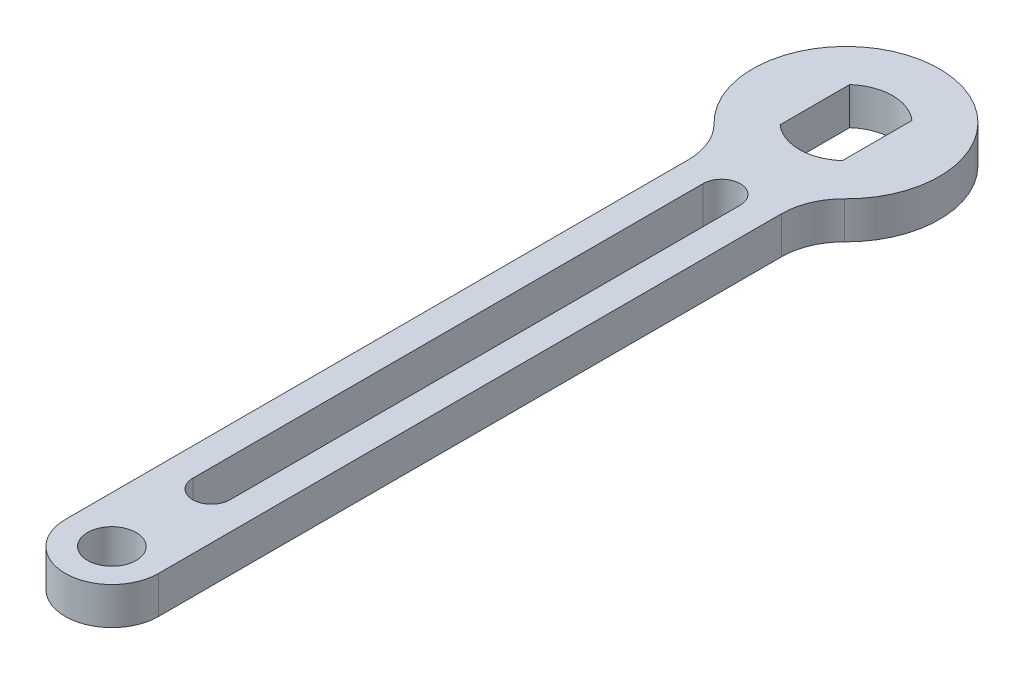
ISO-10303-21;
HEADER;
FILE_DESCRIPTION(('STEP AP214'),'2;1');
FILE_NAME('part.step','',(''),(''),'','','');
FILE_SCHEMA(('AUTOMOTIVE_DESIGN { 1 0 10303 214 1 1 1 1 }'));
ENDSEC;
DATA;
#1=APPLICATION_CONTEXT('core data for automotive mechanical design processes');
#2=APPLICATION_PROTOCOL_DEFINITION('international standard','automotive_design',2000,#1);
#3=PRODUCT_CONTEXT('',#1,'mechanical');
#4=PRODUCT('Part','Part','',(#3));
#5=PRODUCT_RELATED_PRODUCT_CATEGORY('part','',(#4));
#6=PRODUCT_DEFINITION_FORMATION('','',#4);
#7=PRODUCT_DEFINITION_CONTEXT('part definition',#1,'design');
#8=PRODUCT_DEFINITION('design','',#6,#7);
#9=PRODUCT_DEFINITION_SHAPE('','',#8);
#10=(LENGTH_UNIT() NAMED_UNIT(*) SI_UNIT(.MILLI.,.METRE.));
#11=(NAMED_UNIT(*) PLANE_ANGLE_UNIT() SI_UNIT($,.RADIAN.));
#12=(NAMED_UNIT(*) SI_UNIT($,.STERADIAN.) SOLID_ANGLE_UNIT());
#13=UNCERTAINTY_MEASURE_WITH_UNIT(LENGTH_MEASURE(1.E-05),#10,'distance_accuracy_value','');
#14=(GEOMETRIC_REPRESENTATION_CONTEXT(3) GLOBAL_UNCERTAINTY_ASSIGNED_CONTEXT((#13)) GLOBAL_UNIT_ASSIGNED_CONTEXT((#10,
#11,#12)) REPRESENTATION_CONTEXT('',''));
#15=CARTESIAN_POINT('',(0.,0.,0.));
#16=DIRECTION('',(0.,0.,1.));
#17=DIRECTION('',(1.,0.,0.));
#18=AXIS2_PLACEMENT_3D('',#15,#16,#17);
#19=CARTESIAN_POINT('',(-7.50000000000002,-6.,55.25));
#20=DIRECTION('',(-1.,0.,0.));
#21=DIRECTION('',(0.,0.,1.));
#22=AXIS2_PLACEMENT_3D('',#19,#20,#21);
#23=PLANE('',#22);
#24=DIRECTION('',(0.,0.,1.));
#25=VECTOR('',#24,1.);
#26=CARTESIAN_POINT('',(-7.50000000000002,0.,55.25));
#27=LINE('',#26,#25);
#28=CARTESIAN_POINT('',(-7.50000000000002,0.,17.8535710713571));
#29=VERTEX_POINT('',#28);
#30=CARTESIAN_POINT('',(-7.50000000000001,0.,118.));
#31=VERTEX_POINT('',#30);
#32=EDGE_CURVE('E215',#29,#31,#27,.T.);
#33=ORIENTED_EDGE('',*,*,#32,.F.);
#34=DIRECTION('',(0.,-1.,0.));
#35=VECTOR('',#34,1.);
#36=CARTESIAN_POINT('',(-7.50000000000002,-6.,17.8535710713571));
#37=LINE('',#36,#35);
#38=CARTESIAN_POINT('',(-7.50000000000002,-6.,17.8535710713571));
#39=VERTEX_POINT('',#38);
#40=EDGE_CURVE('E244',#29,#39,#37,.T.);
#41=ORIENTED_EDGE('',*,*,#40,.T.);
#42=DIRECTION('',(0.,0.,1.));
#43=VECTOR('',#42,1.);
#44=CARTESIAN_POINT('',(-7.50000000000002,-6.,55.25));
#45=LINE('',#44,#43);
#46=CARTESIAN_POINT('',(-7.50000000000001,-6.,118.));
#47=VERTEX_POINT('',#46);
#48=EDGE_CURVE('E183',#39,#47,#45,.T.);
#49=ORIENTED_EDGE('',*,*,#48,.T.);
#50=DIRECTION('',(0.,1.,0.));
#51=VECTOR('',#50,1.);
#52=CARTESIAN_POINT('',(-7.50000000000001,-6.,118.));
#53=LINE('',#52,#51);
#54=EDGE_CURVE('E225',#47,#31,#53,.T.);
#55=ORIENTED_EDGE('',*,*,#54,.T.);
#56=EDGE_LOOP('',(#33,#41,#49,#55));
#57=FACE_BOUND('',#56,.T.);
#58=ADVANCED_FACE('F34',(#57),#23,.T.);
#59=CARTESIAN_POINT('',(0.,-6.,0.));
#60=DIRECTION('',(0.,1.,0.));
#61=DIRECTION('',(0.,0.,1.));
#62=AXIS2_PLACEMENT_3D('',#59,#60,#61);
#63=CYLINDRICAL_SURFACE('',#62,15.);
#64=CARTESIAN_POINT('',(0.,-6.,0.));
#65=DIRECTION('',(0.,1.,0.));
#66=DIRECTION('',(0.,0.,1.));
#67=AXIS2_PLACEMENT_3D('',#64,#65,#66);
#68=CIRCLE('',#67,15.);
#69=CARTESIAN_POINT('',(10.5,-6.,10.7121426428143));
#70=VERTEX_POINT('',#69);
#71=CARTESIAN_POINT('',(-10.5,-6.,10.7121426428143));
#72=VERTEX_POINT('',#71);
#73=EDGE_CURVE('E156',#70,#72,#68,.T.);
#74=ORIENTED_EDGE('',*,*,#73,.T.);
#75=DIRECTION('',(0.,1.,0.));
#76=VECTOR('',#75,1.);
#77=CARTESIAN_POINT('',(-10.5,-6.,10.7121426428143));
#78=LINE('',#77,#76);
#79=CARTESIAN_POINT('',(-10.5,0.,10.7121426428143));
#80=VERTEX_POINT('',#79);
#81=EDGE_CURVE('E241',#72,#80,#78,.T.);
#82=ORIENTED_EDGE('',*,*,#81,.T.);
#83=CARTESIAN_POINT('',(0.,0.,0.));
#84=DIRECTION('',(0.,1.,0.));
#85=DIRECTION('',(0.,0.,1.));
#86=AXIS2_PLACEMENT_3D('',#83,#84,#85);
#87=CIRCLE('',#86,15.);
#88=CARTESIAN_POINT('',(10.5,0.,10.7121426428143));
#89=VERTEX_POINT('',#88);
#90=EDGE_CURVE('E161',#89,#80,#87,.T.);
#91=ORIENTED_EDGE('',*,*,#90,.F.);
#92=DIRECTION('',(0.,1.,0.));
#93=VECTOR('',#92,1.);
#94=CARTESIAN_POINT('',(10.5,-6.,10.7121426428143));
#95=LINE('',#94,#93);
#96=EDGE_CURVE('E224',#89,#70,#95,.F.);
#97=ORIENTED_EDGE('',*,*,#96,.T.);
#98=EDGE_LOOP('',(#74,#82,#91,#97));
#99=FACE_BOUND('',#98,.T.);
#100=ADVANCED_FACE('F256',(#99),#63,.T.);
#101=CARTESIAN_POINT('',(7.50000000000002,-6.,55.25));
#102=DIRECTION('',(-1.,0.,0.));
#103=DIRECTION('',(0.,0.,1.));
#104=AXIS2_PLACEMENT_3D('',#101,#102,#103);
#105=PLANE('',#104);
#106=DIRECTION('',(0.,0.,1.));
#107=VECTOR('',#106,1.);
#108=CARTESIAN_POINT('',(7.50000000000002,-6.,55.25));
#109=LINE('',#108,#107);
#110=CARTESIAN_POINT('',(7.50000000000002,-6.,17.8535710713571));
#111=VERTEX_POINT('',#110);
#112=CARTESIAN_POINT('',(7.50000000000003,-6.,118.));
#113=VERTEX_POINT('',#112);
#114=EDGE_CURVE('E188',#111,#113,#109,.T.);
#115=ORIENTED_EDGE('',*,*,#114,.F.);
#116=DIRECTION('',(0.,1.,0.));
#117=VECTOR('',#116,1.);
#118=CARTESIAN_POINT('',(7.50000000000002,-6.,17.8535710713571));
#119=LINE('',#118,#117);
#120=CARTESIAN_POINT('',(7.50000000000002,0.,17.8535710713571));
#121=VERTEX_POINT('',#120);
#122=EDGE_CURVE('E246',#111,#121,#119,.T.);
#123=ORIENTED_EDGE('',*,*,#122,.T.);
#124=DIRECTION('',(0.,0.,1.));
#125=VECTOR('',#124,1.);
#126=CARTESIAN_POINT('',(7.50000000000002,0.,55.25));
#127=LINE('',#126,#125);
#128=CARTESIAN_POINT('',(7.50000000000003,0.,118.));
#129=VERTEX_POINT('',#128);
#130=EDGE_CURVE('E164',#121,#129,#127,.T.);
#131=ORIENTED_EDGE('',*,*,#130,.T.);
#132=DIRECTION('',(0.,1.,0.));
#133=VECTOR('',#132,1.);
#134=CARTESIAN_POINT('',(7.50000000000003,-6.,118.));
#135=LINE('',#134,#133);
#136=EDGE_CURVE('E221',#113,#129,#135,.T.);
#137=ORIENTED_EDGE('',*,*,#136,.F.);
#138=EDGE_LOOP('',(#115,#123,#131,#137));
#139=FACE_BOUND('',#138,.T.);
#140=ADVANCED_FACE('F259',(#139),#105,.F.);
#141=CARTESIAN_POINT('',(0.,-6.,0.));
#142=DIRECTION('',(0.,1.,0.));
#143=DIRECTION('',(0.,0.,1.));
#144=AXIS2_PLACEMENT_3D('',#141,#142,#143);
#145=CYLINDRICAL_SURFACE('',#144,7.5);
#146=CARTESIAN_POINT('',(0.,0.,0.));
#147=DIRECTION('',(0.,1.,0.));
#148=DIRECTION('',(0.,0.,1.));
#149=AXIS2_PLACEMENT_3D('',#146,#147,#148);
#150=CIRCLE('',#149,7.5);
#151=CARTESIAN_POINT('',(5.,0.,-5.59016994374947));
#152=VERTEX_POINT('',#151);
#153=CARTESIAN_POINT('',(-5.,0.,-5.59016994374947));
#154=VERTEX_POINT('',#153);
#155=EDGE_CURVE('E200',#152,#154,#150,.T.);
#156=ORIENTED_EDGE('',*,*,#155,.T.);
#157=DIRECTION('',(0.,1.,0.));
#158=VECTOR('',#157,1.);
#159=CARTESIAN_POINT('',(-5.,-6.,-5.59016994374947));
#160=LINE('',#159,#158);
#161=CARTESIAN_POINT('',(-5.,-6.,-5.59016994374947));
#162=VERTEX_POINT('',#161);
#163=EDGE_CURVE('E228',#162,#154,#160,.T.);
#164=ORIENTED_EDGE('',*,*,#163,.F.);
#165=CARTESIAN_POINT('',(0.,-6.,0.));
#166=DIRECTION('',(0.,1.,0.));
#167=DIRECTION('',(0.,0.,1.));
#168=AXIS2_PLACEMENT_3D('',#165,#166,#167);
#169=CIRCLE('',#168,7.5);
#170=CARTESIAN_POINT('',(5.,-6.,-5.59016994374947));
#171=VERTEX_POINT('',#170);
#172=EDGE_CURVE('E170',#171,#162,#169,.T.);
#173=ORIENTED_EDGE('',*,*,#172,.F.);
#174=DIRECTION('',(0.,1.,0.));
#175=VECTOR('',#174,1.);
#176=CARTESIAN_POINT('',(5.,-6.,-5.59016994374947));
#177=LINE('',#176,#175);
#178=EDGE_CURVE('E234',#171,#152,#177,.T.);
#179=ORIENTED_EDGE('',*,*,#178,.T.);
#180=EDGE_LOOP('',(#156,#164,#173,#179));
#181=FACE_BOUND('',#180,.T.);
#182=ADVANCED_FACE('F300',(#181),#145,.F.);
#183=CARTESIAN_POINT('',(-5.,-6.,55.25));
#184=DIRECTION('',(1.,0.,0.));
#185=DIRECTION('',(0.,0.,-1.));
#186=AXIS2_PLACEMENT_3D('',#183,#184,#185);
#187=PLANE('',#186);
#188=DIRECTION('',(0.,0.,-1.));
#189=VECTOR('',#188,1.);
#190=CARTESIAN_POINT('',(-5.,0.,55.25));
#191=LINE('',#190,#189);
#192=CARTESIAN_POINT('',(-5.,0.,5.59016994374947));
#193=VERTEX_POINT('',#192);
#194=EDGE_CURVE('E209',#193,#154,#191,.T.);
#195=ORIENTED_EDGE('',*,*,#194,.F.);
#196=DIRECTION('',(0.,1.,0.));
#197=VECTOR('',#196,1.);
#198=CARTESIAN_POINT('',(-5.,-6.,5.59016994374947));
#199=LINE('',#198,#197);
#200=CARTESIAN_POINT('',(-5.,-6.,5.59016994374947));
#201=VERTEX_POINT('',#200);
#202=EDGE_CURVE('E230',#201,#193,#199,.T.);
#203=ORIENTED_EDGE('',*,*,#202,.F.);
#204=DIRECTION('',(0.,0.,-1.));
#205=VECTOR('',#204,1.);
#206=CARTESIAN_POINT('',(-5.,-6.,55.25));
#207=LINE('',#206,#205);
#208=EDGE_CURVE('E177',#201,#162,#207,.T.);
#209=ORIENTED_EDGE('',*,*,#208,.T.);
#210=ORIENTED_EDGE('',*,*,#163,.T.);
#211=EDGE_LOOP('',(#195,#203,#209,#210));
#212=FACE_BOUND('',#211,.T.);
#213=ADVANCED_FACE('F296',(#212),#187,.T.);
#214=CARTESIAN_POINT('',(0.,-6.,0.));
#215=DIRECTION('',(0.,1.,0.));
#216=DIRECTION('',(0.,0.,1.));
#217=AXIS2_PLACEMENT_3D('',#214,#215,#216);
#218=CYLINDRICAL_SURFACE('',#217,7.5);
#219=CARTESIAN_POINT('',(0.,0.,0.));
#220=DIRECTION('',(0.,1.,0.));
#221=DIRECTION('',(0.,0.,1.));
#222=AXIS2_PLACEMENT_3D('',#219,#220,#221);
#223=CIRCLE('',#222,7.5);
#224=CARTESIAN_POINT('',(5.,0.,5.59016994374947));
#225=VERTEX_POINT('',#224);
#226=EDGE_CURVE('E206',#193,#225,#223,.T.);
#227=ORIENTED_EDGE('',*,*,#226,.T.);
#228=DIRECTION('',(0.,1.,0.));
#229=VECTOR('',#228,1.);
#230=CARTESIAN_POINT('',(5.,-6.,5.59016994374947));
#231=LINE('',#230,#229);
#232=CARTESIAN_POINT('',(5.,-6.,5.59016994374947));
#233=VERTEX_POINT('',#232);
#234=EDGE_CURVE('E232',#233,#225,#231,.T.);
#235=ORIENTED_EDGE('',*,*,#234,.F.);
#236=CARTESIAN_POINT('',(0.,-6.,0.));
#237=DIRECTION('',(0.,1.,0.));
#238=DIRECTION('',(0.,0.,1.));
#239=AXIS2_PLACEMENT_3D('',#236,#237,#238);
#240=CIRCLE('',#239,7.5);
#241=EDGE_CURVE('E175',#201,#233,#240,.T.);
#242=ORIENTED_EDGE('',*,*,#241,.F.);
#243=ORIENTED_EDGE('',*,*,#202,.T.);
#244=EDGE_LOOP('',(#227,#235,#242,#243));
#245=FACE_BOUND('',#244,.T.);
#246=ADVANCED_FACE('F299',(#245),#218,.F.);
#247=CARTESIAN_POINT('',(0.,-6.,102.));
#248=DIRECTION('',(0.,1.,0.));
#249=DIRECTION('',(0.,0.,1.));
#250=AXIS2_PLACEMENT_3D('',#247,#248,#249);
#251=CYLINDRICAL_SURFACE('',#250,3.);
#252=CARTESIAN_POINT('',(0.,0.,102.));
#253=DIRECTION('',(0.,1.,0.));
#254=DIRECTION('',(0.,0.,1.));
#255=AXIS2_PLACEMENT_3D('',#252,#253,#254);
#256=CIRCLE('',#255,3.);
#257=CARTESIAN_POINT('',(-2.99999999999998,0.,102.));
#258=VERTEX_POINT('',#257);
#259=CARTESIAN_POINT('',(3.00000000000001,0.,102.));
#260=VERTEX_POINT('',#259);
#261=EDGE_CURVE('E192',#258,#260,#256,.T.);
#262=ORIENTED_EDGE('',*,*,#261,.T.);
#263=DIRECTION('',(0.,1.,0.));
#264=VECTOR('',#263,1.);
#265=CARTESIAN_POINT('',(3.00000000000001,-6.,102.));
#266=LINE('',#265,#264);
#267=CARTESIAN_POINT('',(3.00000000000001,-6.,102.));
#268=VERTEX_POINT('',#267);
#269=EDGE_CURVE('E159',#268,#260,#266,.T.);
#270=ORIENTED_EDGE('',*,*,#269,.F.);
#271=CARTESIAN_POINT('',(0.,-6.,102.));
#272=DIRECTION('',(0.,1.,0.));
#273=DIRECTION('',(0.,0.,1.));
#274=AXIS2_PLACEMENT_3D('',#271,#272,#273);
#275=CIRCLE('',#274,3.);
#276=CARTESIAN_POINT('',(-2.99999999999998,-6.,102.));
#277=VERTEX_POINT('',#276);
#278=EDGE_CURVE('E139',#277,#268,#275,.T.);
#279=ORIENTED_EDGE('',*,*,#278,.F.);
#280=DIRECTION('',(0.,1.,0.));
#281=VECTOR('',#280,1.);
#282=CARTESIAN_POINT('',(-2.99999999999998,-6.,102.));
#283=LINE('',#282,#281);
#284=EDGE_CURVE('E148',#277,#258,#283,.T.);
#285=ORIENTED_EDGE('',*,*,#284,.T.);
#286=EDGE_LOOP('',(#262,#270,#279,#285));
#287=FACE_BOUND('',#286,.T.);
#288=ADVANCED_FACE('F158',(#287),#251,.F.);
#289=CARTESIAN_POINT('',(3.,-6.,55.25));
#290=DIRECTION('',(-1.,0.,0.));
#291=DIRECTION('',(0.,0.,1.));
#292=AXIS2_PLACEMENT_3D('',#289,#290,#291);
#293=PLANE('',#292);
#294=DIRECTION('',(0.,0.,1.));
#295=VECTOR('',#294,1.);
#296=CARTESIAN_POINT('',(3.,0.,55.25));
#297=LINE('',#296,#295);
#298=CARTESIAN_POINT('',(3.,0.,20.));
#299=VERTEX_POINT('',#298);
#300=EDGE_CURVE('E197',#299,#260,#297,.T.);
#301=ORIENTED_EDGE('',*,*,#300,.F.);
#302=DIRECTION('',(0.,1.,0.));
#303=VECTOR('',#302,1.);
#304=CARTESIAN_POINT('',(3.,-6.,20.));
#305=LINE('',#304,#303);
#306=CARTESIAN_POINT('',(3.,-6.,20.));
#307=VERTEX_POINT('',#306);
#308=EDGE_CURVE('E237',#307,#299,#305,.T.);
#309=ORIENTED_EDGE('',*,*,#308,.F.);
#310=DIRECTION('',(0.,0.,1.));
#311=VECTOR('',#310,1.);
#312=CARTESIAN_POINT('',(3.,-6.,55.25));
#313=LINE('',#312,#311);
#314=EDGE_CURVE('E168',#307,#268,#313,.T.);
#315=ORIENTED_EDGE('',*,*,#314,.T.);
#316=ORIENTED_EDGE('',*,*,#269,.T.);
#317=EDGE_LOOP('',(#301,#309,#315,#316));
#318=FACE_BOUND('',#317,.T.);
#319=ADVANCED_FACE('F311',(#318),#293,.T.);
#320=CARTESIAN_POINT('',(0.,-6.,20.));
#321=DIRECTION('',(0.,1.,0.));
#322=DIRECTION('',(0.,0.,1.));
#323=AXIS2_PLACEMENT_3D('',#320,#321,#322);
#324=CYLINDRICAL_SURFACE('',#323,3.);
#325=CARTESIAN_POINT('',(0.,0.,20.));
#326=DIRECTION('',(0.,1.,0.));
#327=DIRECTION('',(0.,0.,1.));
#328=AXIS2_PLACEMENT_3D('',#325,#326,#327);
#329=CIRCLE('',#328,3.);
#330=CARTESIAN_POINT('',(-2.99999999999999,0.,20.));
#331=VERTEX_POINT('',#330);
#332=EDGE_CURVE('E195',#299,#331,#329,.T.);
#333=ORIENTED_EDGE('',*,*,#332,.T.);
#334=DIRECTION('',(0.,1.,0.));
#335=VECTOR('',#334,1.);
#336=CARTESIAN_POINT('',(-2.99999999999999,-6.,20.));
#337=LINE('',#336,#335);
#338=CARTESIAN_POINT('',(-2.99999999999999,-6.,20.));
#339=VERTEX_POINT('',#338);
#340=EDGE_CURVE('E155',#339,#331,#337,.T.);
#341=ORIENTED_EDGE('',*,*,#340,.F.);
#342=CARTESIAN_POINT('',(0.,-6.,20.));
#343=DIRECTION('',(0.,1.,0.));
#344=DIRECTION('',(0.,0.,1.));
#345=AXIS2_PLACEMENT_3D('',#342,#343,#344);
#346=CIRCLE('',#345,3.);
#347=EDGE_CURVE('E142',#307,#339,#346,.T.);
#348=ORIENTED_EDGE('',*,*,#347,.F.);
#349=ORIENTED_EDGE('',*,*,#308,.T.);
#350=EDGE_LOOP('',(#333,#341,#348,#349));
#351=FACE_BOUND('',#350,.T.);
#352=ADVANCED_FACE('F294',(#351),#324,.F.);
#353=CARTESIAN_POINT('',(0.,-6.,118.));
#354=DIRECTION('',(0.,1.,0.));
#355=DIRECTION('',(0.,0.,1.));
#356=AXIS2_PLACEMENT_3D('',#353,#354,#355);
#357=CYLINDRICAL_SURFACE('',#356,3.9);
#358=CARTESIAN_POINT('',(0.,-6.,118.));
#359=DIRECTION('',(0.,1.,0.));
#360=DIRECTION('',(0.,0.,1.));
#361=AXIS2_PLACEMENT_3D('',#358,#359,#360);
#362=CIRCLE('',#361,3.9);
#363=CARTESIAN_POINT('',(0.,-6.,121.9));
#364=VERTEX_POINT('',#363);
#365=EDGE_CURVE('E180',#364,#364,#362,.T.);
#366=ORIENTED_EDGE('',*,*,#365,.F.);
#367=EDGE_LOOP('',(#366));
#368=FACE_BOUND('',#367,.T.);
#369=CARTESIAN_POINT('',(0.,0.,118.));
#370=DIRECTION('',(0.,1.,0.));
#371=DIRECTION('',(0.,0.,1.));
#372=AXIS2_PLACEMENT_3D('',#369,#370,#371);
#373=CIRCLE('',#372,3.9);
#374=CARTESIAN_POINT('',(0.,0.,121.9));
#375=VERTEX_POINT('',#374);
#376=EDGE_CURVE('E212',#375,#375,#373,.T.);
#377=ORIENTED_EDGE('',*,*,#376,.T.);
#378=EDGE_LOOP('',(#377));
#379=FACE_BOUND('',#378,.T.);
#380=ADVANCED_FACE('F290',(#368,#379),#357,.F.);
#381=CARTESIAN_POINT('',(5.,-6.,55.25));
#382=DIRECTION('',(-1.,0.,0.));
#383=DIRECTION('',(0.,0.,1.));
#384=AXIS2_PLACEMENT_3D('',#381,#382,#383);
#385=PLANE('',#384);
#386=DIRECTION('',(0.,0.,1.));
#387=VECTOR('',#386,1.);
#388=CARTESIAN_POINT('',(5.,0.,55.25));
#389=LINE('',#388,#387);
#390=EDGE_CURVE('E203',#152,#225,#389,.T.);
#391=ORIENTED_EDGE('',*,*,#390,.F.);
#392=ORIENTED_EDGE('',*,*,#178,.F.);
#393=DIRECTION('',(0.,0.,1.));
#394=VECTOR('',#393,1.);
#395=CARTESIAN_POINT('',(5.,-6.,55.25));
#396=LINE('',#395,#394);
#397=EDGE_CURVE('E172',#171,#233,#396,.T.);
#398=ORIENTED_EDGE('',*,*,#397,.T.);
#399=ORIENTED_EDGE('',*,*,#234,.T.);
#400=EDGE_LOOP('',(#391,#392,#398,#399));
#401=FACE_BOUND('',#400,.T.);
#402=ADVANCED_FACE('F293',(#401),#385,.T.);
#403=CARTESIAN_POINT('',(-2.99999999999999,-6.,55.25));
#404=DIRECTION('',(-1.,0.,0.));
#405=DIRECTION('',(0.,0.,1.));
#406=AXIS2_PLACEMENT_3D('',#403,#404,#405);
#407=PLANE('',#406);
#408=DIRECTION('',(0.,0.,1.));
#409=VECTOR('',#408,1.);
#410=CARTESIAN_POINT('',(-2.99999999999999,0.,55.25));
#411=LINE('',#410,#409);
#412=EDGE_CURVE('E151',#331,#258,#411,.T.);
#413=ORIENTED_EDGE('',*,*,#412,.T.);
#414=ORIENTED_EDGE('',*,*,#284,.F.);
#415=DIRECTION('',(0.,0.,1.));
#416=VECTOR('',#415,1.);
#417=CARTESIAN_POINT('',(-2.99999999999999,-6.,55.25));
#418=LINE('',#417,#416);
#419=EDGE_CURVE('E133',#339,#277,#418,.T.);
#420=ORIENTED_EDGE('',*,*,#419,.F.);
#421=ORIENTED_EDGE('',*,*,#340,.T.);
#422=EDGE_LOOP('',(#413,#414,#420,#421));
#423=FACE_BOUND('',#422,.T.);
#424=ADVANCED_FACE('F149',(#423),#407,.F.);
#425=CARTESIAN_POINT('',(0.,-6.,118.));
#426=DIRECTION('',(0.,1.,0.));
#427=DIRECTION('',(0.,0.,1.));
#428=AXIS2_PLACEMENT_3D('',#425,#426,#427);
#429=CYLINDRICAL_SURFACE('',#428,7.50000000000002);
#430=CARTESIAN_POINT('',(0.,0.,118.));
#431=DIRECTION('',(0.,1.,0.));
#432=DIRECTION('',(0.,0.,1.));
#433=AXIS2_PLACEMENT_3D('',#430,#431,#432);
#434=CIRCLE('',#433,7.50000000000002);
#435=EDGE_CURVE('E217',#31,#129,#434,.T.);
#436=ORIENTED_EDGE('',*,*,#435,.F.);
#437=ORIENTED_EDGE('',*,*,#54,.F.);
#438=CARTESIAN_POINT('',(0.,-6.,118.));
#439=DIRECTION('',(0.,1.,0.));
#440=DIRECTION('',(0.,0.,1.));
#441=AXIS2_PLACEMENT_3D('',#438,#439,#440);
#442=CIRCLE('',#441,7.50000000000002);
#443=EDGE_CURVE('E185',#47,#113,#442,.T.);
#444=ORIENTED_EDGE('',*,*,#443,.T.);
#445=ORIENTED_EDGE('',*,*,#136,.T.);
#446=EDGE_LOOP('',(#436,#437,#444,#445));
#447=FACE_BOUND('',#446,.T.);
#448=ADVANCED_FACE('F267',(#447),#429,.T.);
#449=CARTESIAN_POINT('',(-111.888238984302,-6.,55.25));
#450=DIRECTION('',(0.,1.,0.));
#451=DIRECTION('',(0.,0.,1.));
#452=AXIS2_PLACEMENT_3D('',#449,#450,#451);
#453=PLANE('',#452);
#454=ORIENTED_EDGE('',*,*,#278,.T.);
#455=ORIENTED_EDGE('',*,*,#314,.F.);
#456=ORIENTED_EDGE('',*,*,#347,.T.);
#457=ORIENTED_EDGE('',*,*,#419,.T.);
#458=EDGE_LOOP('',(#454,#455,#456,#457));
#459=FACE_BOUND('',#458,.T.);
#460=ORIENTED_EDGE('',*,*,#172,.T.);
#461=ORIENTED_EDGE('',*,*,#208,.F.);
#462=ORIENTED_EDGE('',*,*,#241,.T.);
#463=ORIENTED_EDGE('',*,*,#397,.F.);
#464=EDGE_LOOP('',(#460,#461,#462,#463));
#465=FACE_BOUND('',#464,.T.);
#466=ORIENTED_EDGE('',*,*,#365,.T.);
#467=EDGE_LOOP('',(#466));
#468=FACE_BOUND('',#467,.T.);
#469=ORIENTED_EDGE('',*,*,#48,.F.);
#470=CARTESIAN_POINT('',(-17.5,-6.,17.8535710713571));
#471=DIRECTION('',(0.,1.,0.));
#472=DIRECTION('',(0.,0.,1.));
#473=AXIS2_PLACEMENT_3D('',#470,#471,#472);
#474=CIRCLE('',#473,10.);
#475=EDGE_CURVE('E250',#39,#72,#474,.T.);
#476=ORIENTED_EDGE('',*,*,#475,.T.);
#477=ORIENTED_EDGE('',*,*,#73,.F.);
#478=CARTESIAN_POINT('',(17.5,-6.,17.8535710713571));
#479=DIRECTION('',(0.,1.,0.));
#480=DIRECTION('',(0.,0.,1.));
#481=AXIS2_PLACEMENT_3D('',#478,#479,#480);
#482=CIRCLE('',#481,10.);
#483=EDGE_CURVE('E11',#70,#111,#482,.T.);
#484=ORIENTED_EDGE('',*,*,#483,.T.);
#485=ORIENTED_EDGE('',*,*,#114,.T.);
#486=ORIENTED_EDGE('',*,*,#443,.F.);
#487=EDGE_LOOP('',(#469,#476,#477,#484,#485,#486));
#488=FACE_BOUND('',#487,.T.);
#489=ADVANCED_FACE('F135',(#459,#465,#468,#488),#453,.F.);
#490=CARTESIAN_POINT('',(-111.888238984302,0.,55.25));
#491=DIRECTION('',(0.,1.,0.));
#492=DIRECTION('',(0.,0.,1.));
#493=AXIS2_PLACEMENT_3D('',#490,#491,#492);
#494=PLANE('',#493);
#495=ORIENTED_EDGE('',*,*,#261,.F.);
#496=ORIENTED_EDGE('',*,*,#412,.F.);
#497=ORIENTED_EDGE('',*,*,#332,.F.);
#498=ORIENTED_EDGE('',*,*,#300,.T.);
#499=EDGE_LOOP('',(#495,#496,#497,#498));
#500=FACE_BOUND('',#499,.T.);
#501=ORIENTED_EDGE('',*,*,#155,.F.);
#502=ORIENTED_EDGE('',*,*,#390,.T.);
#503=ORIENTED_EDGE('',*,*,#226,.F.);
#504=ORIENTED_EDGE('',*,*,#194,.T.);
#505=EDGE_LOOP('',(#501,#502,#503,#504));
#506=FACE_BOUND('',#505,.T.);
#507=ORIENTED_EDGE('',*,*,#376,.F.);
#508=EDGE_LOOP('',(#507));
#509=FACE_BOUND('',#508,.T.);
#510=ORIENTED_EDGE('',*,*,#90,.T.);
#511=CARTESIAN_POINT('',(-17.5,0.,17.8535710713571));
#512=DIRECTION('',(0.,1.,0.));
#513=DIRECTION('',(0.,0.,1.));
#514=AXIS2_PLACEMENT_3D('',#511,#512,#513);
#515=CIRCLE('',#514,10.);
#516=EDGE_CURVE('E248',#80,#29,#515,.F.);
#517=ORIENTED_EDGE('',*,*,#516,.T.);
#518=ORIENTED_EDGE('',*,*,#32,.T.);
#519=ORIENTED_EDGE('',*,*,#435,.T.);
#520=ORIENTED_EDGE('',*,*,#130,.F.);
#521=CARTESIAN_POINT('',(17.5,0.,17.8535710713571));
#522=DIRECTION('',(0.,1.,0.));
#523=DIRECTION('',(0.,0.,1.));
#524=AXIS2_PLACEMENT_3D('',#521,#522,#523);
#525=CIRCLE('',#524,10.);
#526=EDGE_CURVE('E42',#121,#89,#525,.F.);
#527=ORIENTED_EDGE('',*,*,#526,.T.);
#528=EDGE_LOOP('',(#510,#517,#518,#519,#520,#527));
#529=FACE_BOUND('',#528,.T.);
#530=ADVANCED_FACE('F254',(#500,#506,#509,#529),#494,.T.);
#531=CARTESIAN_POINT('',(-17.5,-6.,17.8535710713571));
#532=DIRECTION('',(0.,1.,0.));
#533=DIRECTION('',(0.,0.,1.));
#534=AXIS2_PLACEMENT_3D('',#531,#532,#533);
#535=CYLINDRICAL_SURFACE('',#534,10.);
#536=ORIENTED_EDGE('',*,*,#475,.F.);
#537=ORIENTED_EDGE('',*,*,#40,.F.);
#538=ORIENTED_EDGE('',*,*,#516,.F.);
#539=ORIENTED_EDGE('',*,*,#81,.F.);
#540=EDGE_LOOP('',(#536,#537,#538,#539));
#541=FACE_BOUND('',#540,.T.);
#542=ADVANCED_FACE('F272',(#541),#535,.F.);
#543=CARTESIAN_POINT('',(17.5,-6.,17.8535710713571));
#544=DIRECTION('',(0.,1.,0.));
#545=DIRECTION('',(0.,0.,1.));
#546=AXIS2_PLACEMENT_3D('',#543,#544,#545);
#547=CYLINDRICAL_SURFACE('',#546,10.);
#548=ORIENTED_EDGE('',*,*,#483,.F.);
#549=ORIENTED_EDGE('',*,*,#96,.F.);
#550=ORIENTED_EDGE('',*,*,#526,.F.);
#551=ORIENTED_EDGE('',*,*,#122,.F.);
#552=EDGE_LOOP('',(#548,#549,#550,#551));
#553=FACE_BOUND('',#552,.T.);
#554=ADVANCED_FACE('F36',(#553),#547,.F.);
#555=CLOSED_SHELL('',(#58,#100,#140,#182,#213,#246,#288,#319,#352,#380,#402,#424,#448,#489,#530,
#542,#554));
#556=MANIFOLD_SOLID_BREP('B2',#555);
#557=ADVANCED_BREP_SHAPE_REPRESENTATION('',(#18,#556),#14);
#558=SHAPE_DEFINITION_REPRESENTATION(#9,#557);
ENDSEC;
END-ISO-10303-21;
